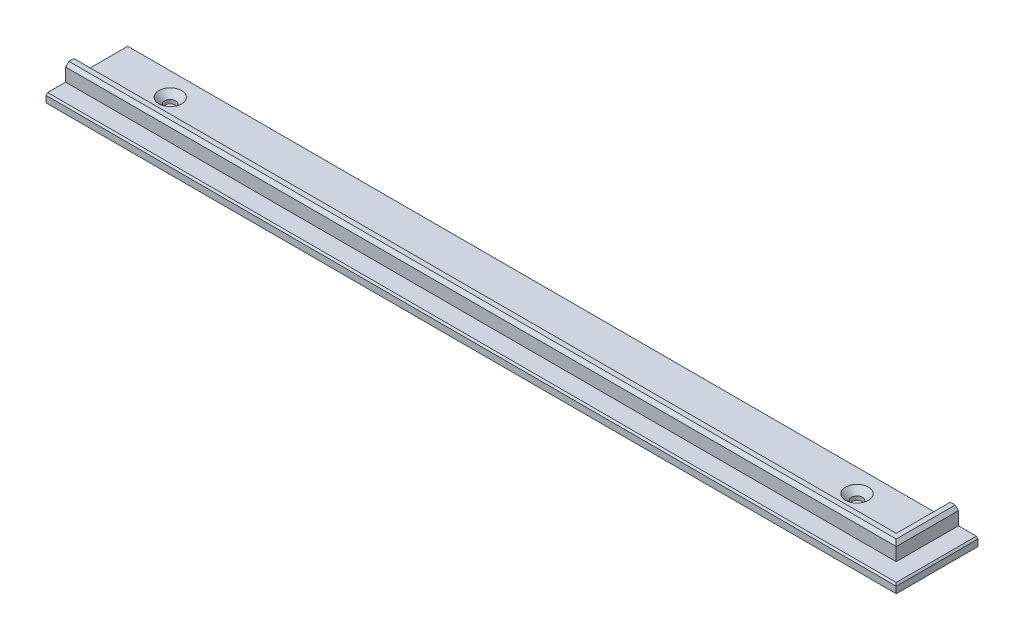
from build123d import *

# Parameters (mm, degrees)
SKIZZE1_W                                   = 260
SKIZZE1_H                                   = 25
AUFSATZ_LINEAR_AUSTRAGEN1_DEPTH             = 3
AUFSATZ_LINEAR_AUSTRAGEN2_DEPTH             = 5
FASE1_SIZE                                  = 0.5
FASE2_SIZE                                  = 1
FORMSENKUNG_F_R_M3_SENKSCHRAUBE_MIT_2_COUNT = 2
FORMSENKUNG_F_R_M3_SENKSCHRAUBE_MIT_2_PITCH = 210


with BuildPart() as part:
    # Skizze1 → Aufsatz-Linear austragen1 (new body)
    with BuildSketch(Plane(origin=(0, 0, 0), x_dir=(1, 0, 0), z_dir=(0, 1, 0))):
        Rectangle(SKIZZE1_W, SKIZZE1_H)
    extrude(amount=AUFSATZ_LINEAR_AUSTRAGEN1_DEPTH)

    # Skizze2 → Aufsatz-Linear austragen2 (add)
    with BuildSketch(Plane(origin=(0, 3, 0), x_dir=(1, 0, 0), z_dir=(0, 1, 0))):
        Polygon((-130, -3.5), (121, -3.5), (121, 12.5), (124, 12.5), (124, -6.5), (-130, -6.5), align=None)
    extrude(amount=AUFSATZ_LINEAR_AUSTRAGEN2_DEPTH)

    # Fase1
    fase1_edges = [part.edges().sort_by_distance(p)[0] for p in [
        (0, 3, 12.5),
        (121, 8, -4.5),
        (-4.5, 8, 3.5),
        (130, 3, 0),
        (0, 0, 12.5),
        (-130, 0, 0),
        (0, 0, -12.5),
        (130, 0, 0),
    ]]
    chamfer(fase1_edges, length=FASE1_SIZE)

    # Fase2
    fase2_edges = [part.edges().sort_by_distance(p)[0] for p in [
        (-3, 8, 6.5),
        (124, 8, -3),
    ]]
    chamfer(fase2_edges, length=FASE2_SIZE)

    # Skizze4 → Formsenkung f_r M3 Senkschraube mit Inne (revolve, cut)
    with BuildSketch(Plane(origin=(100, 3, -5.5), x_dir=(0, 0, 1), z_dir=(1, 0, 0))):
        Polygon((0, 0), (0, 3), (1.7, 3), (1.7, 1.8), (3.5, 0), align=None)
    formsenkung_f_r_m3_senkschraube_mit_inne = revolve(axis=Axis((100, 9.35, -5.5), (0, -1, 0)), mode=Mode.SUBTRACT)

    # Formsenkung f_r M3 Senkschraube mit  2: Formsenkung f_r M3 Senkschraube mit Inne ×2
    with Locations(*[(-i * FORMSENKUNG_F_R_M3_SENKSCHRAUBE_MIT_2_PITCH, 0, 0) for i in range(1, FORMSENKUNG_F_R_M3_SENKSCHRAUBE_MIT_2_COUNT)]):
        add(formsenkung_f_r_m3_senkschraube_mit_inne, mode=Mode.SUBTRACT)


solid = part.part
